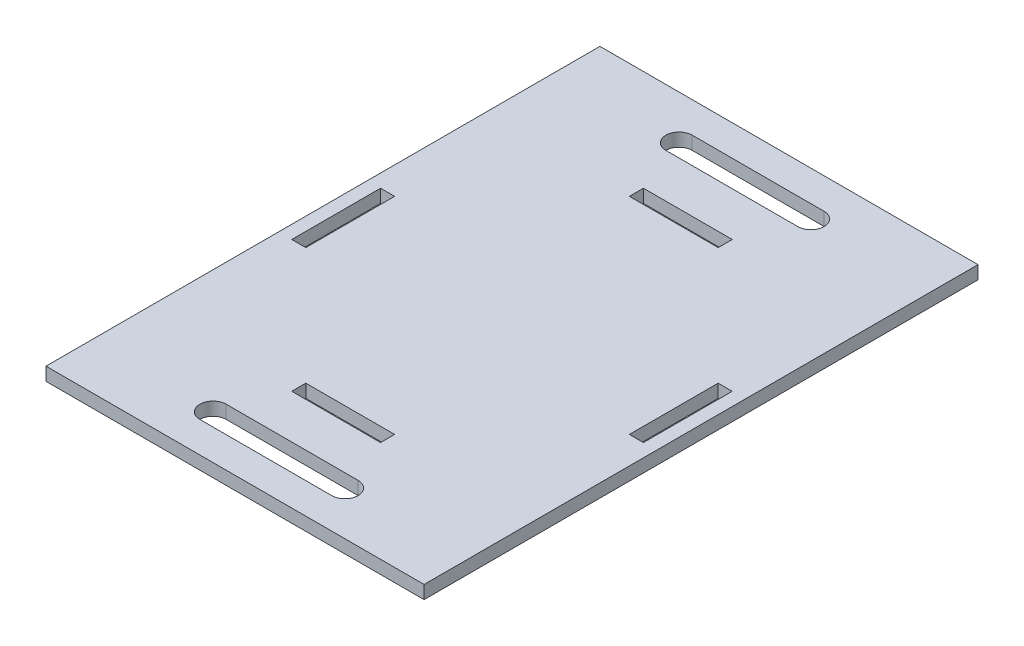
from build123d import *

# Parameters (mm, degrees)
CROQUIS1_W              = 430
CROQUIS1_H              = 430
CROQUIS1_W_2            = 16
CROQUIS1_H_2            = 101
CROQUIS1_W_3            = 101
CROQUIS1_H_3            = 16
SALIENTE_EXTRUIR1_DEPTH = 15
CROQUIS2_W              = 430
CROQUIS2_H              = 100
SALIENTE_EXTRUIR2_DEPTH = 15


with BuildPart() as part:
    # Croquis1 → Saliente-Extruir1 (new body)
    with BuildSketch(Plane(origin=(0, 0, 0), x_dir=(1, 0, 0), z_dir=(0, 1, 0))):
        Rectangle(CROQUIS1_W, CROQUIS1_H)
        with Locations((192, 0)):
            Rectangle(CROQUIS1_W_2, CROQUIS1_H_2, mode=Mode.SUBTRACT)
        with Locations((-192, 0)):
            Rectangle(CROQUIS1_W_2, CROQUIS1_H_2, mode=Mode.SUBTRACT)
        with Locations((0, 192)):
            Rectangle(CROQUIS1_W_3, CROQUIS1_H_3, mode=Mode.SUBTRACT)
        with Locations((0, -192)):
            Rectangle(CROQUIS1_W_3, CROQUIS1_H_3, mode=Mode.SUBTRACT)
    extrude(amount=SALIENTE_EXTRUIR1_DEPTH)

    # Croquis2 → Saliente-Extruir2 (add)
    # profile 1 of 2: a face of its own
    with BuildSketch(Plane(origin=(0, 15, 0), x_dir=(1, 0, 0), z_dir=(0, 1, 0))):
        with Locations((0, 265)):
            Rectangle(CROQUIS2_W, CROQUIS2_H)
        with BuildLine():
            Line((75, 250), (-75, 250))
            ThreePointArc((-75, 250), (-90, 265), (-75, 280))
            Line((-75, 280), (75, 280))
            ThreePointArc((75, 280), (90, 265), (75, 250))
        make_face(mode=Mode.SUBTRACT)
    # profile 2 of 2: a face of its own
    with BuildSketch(Plane(origin=(0, 15, 0), x_dir=(1, 0, 0), z_dir=(0, 1, 0))):
        with Locations((0, -265)):
            Rectangle(CROQUIS2_W, CROQUIS2_H)
        with BuildLine():
            Line((75, -250), (-75, -250))
            ThreePointArc((-75, -250), (-90, -265), (-75, -280))
            Line((-75, -280), (75, -280))
            ThreePointArc((75, -280), (90, -265), (75, -250))
        make_face(mode=Mode.SUBTRACT)
    extrude(amount=-SALIENTE_EXTRUIR2_DEPTH)


solid = part.part
